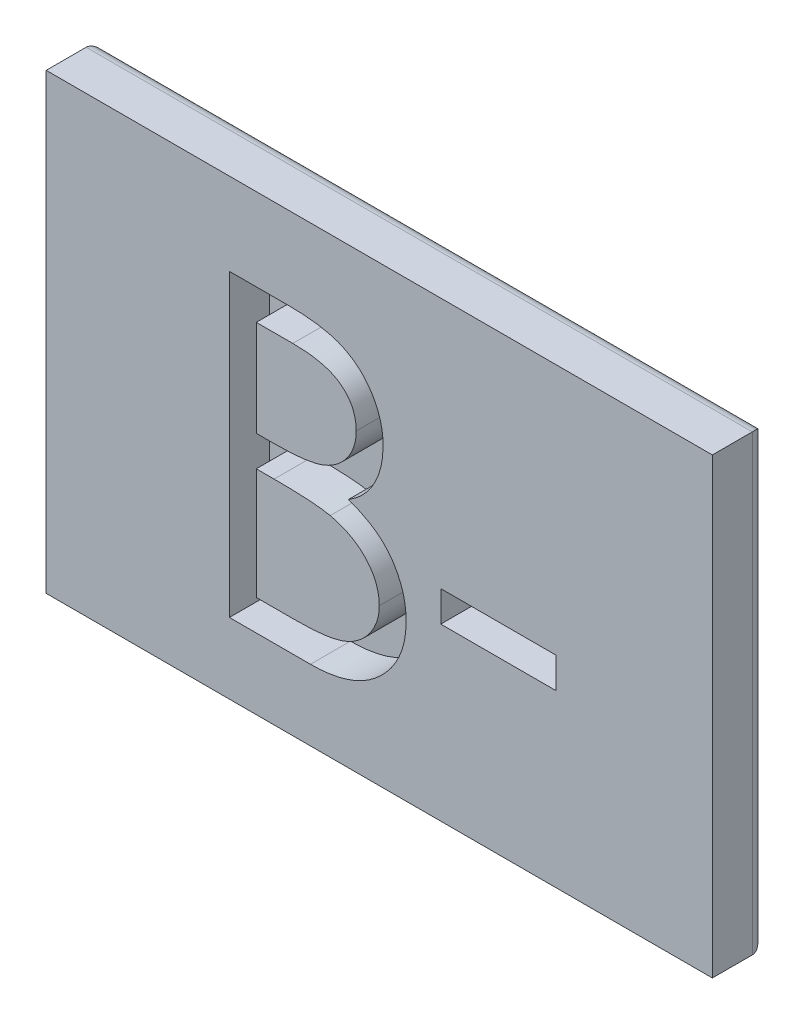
from build123d import *

# Parameters (mm, degrees)
SKETCH1_W           = 31.75
SKETCH1_H           = 21.59
BOSS_EXTRUDE1_DEPTH = 2.54
FILLET1_R           = 0.635
SKETCH2_W           = 5.495192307
SKETCH2_H           = 1.465384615
CUT_EXTRUDE1_DEPTH  = 1.905


with BuildPart() as part:
    # Sketch1 → Boss-Extrude1 (new body)
    with BuildSketch(Plane.XY):
        Rectangle(SKETCH1_W, SKETCH1_H)
    extrude(amount=BOSS_EXTRUDE1_DEPTH)

    # Fillet1
    fillet1_edges = [part.edges().sort_by_distance(p)[0] for p in [
        (0, -10.795, 0),
        (-15.875, 0, 0),
        (0, 10.795, 0),
        (15.875, 0, 0),
    ]]
    fillet(fillet1_edges, radius=FILLET1_R)

    # Sketch2 → Cut-Extrude1 (cut)
    # profile 1 of 2: a face of its own
    with BuildSketch(Plane.XY.offset(2.54)):
        with BuildLine():
            Line((-7.14375, 6.864769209), (-4.356084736, 6.864769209))
            add(Edge.make_bspline(
                [(-4.356084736, 6.864769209), (-4.219624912, 6.864051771), (-3.955131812, 6.862661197), (-3.570514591, 6.841094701), (-3.210270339, 6.811688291), (-2.874294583, 6.76502902), (-2.562742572, 6.708729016), (-2.274675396, 6.640549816), (-2.011009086, 6.558798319), (-1.69622388, 6.428797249), (-1.337319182, 6.235617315), (-0.948705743, 5.950158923), (-0.616402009, 5.601003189), (-0.329891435, 5.207147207), (-0.102103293, 4.773885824), (0.062689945, 4.311545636), (0.167020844, 3.826090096), (0.177750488, 3.492810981), (0.183173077, 3.324377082)],
                knots=[0, 0, 0, 0, 1.001505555, 1.941167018, 2.826882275, 3.653841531, 4.429895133, 5.150066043, 5.825578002, 6.45369114, 7.647487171, 8.808567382, 9.977351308, 11.170798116, 12.373658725, 13.556498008, 14.765093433, 16, 16, 16, 16], degree=3))
            add(Edge.make_bspline(
                [(0.183173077, 3.324377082), (0.178710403, 3.166591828), (0.169940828, 2.856528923), (0.08608235, 2.403026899), (-0.045202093, 1.971335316), (-0.227695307, 1.56302965), (-0.464875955, 1.187335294), (-0.745965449, 0.841221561), (-1.085096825, 0.539342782), (-1.339182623, 0.370575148), (-1.468246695, 0.284848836)],
                knots=[0, 0, 0, 0, 1.044552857, 2.05264487, 3.044412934, 4.028983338, 5.005914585, 5.980388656, 6.974128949, 8, 8, 8, 8], degree=3))
            add(Edge.make_bspline(
                [(-1.468246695, 0.284848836), (-1.305938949, 0.22253493), (-0.995404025, 0.103312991), (-0.568060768, -0.10747035), (-0.199872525, -0.336732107), (0.111991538, -0.587097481), (0.37870918, -0.856963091), (0.611607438, -1.150285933), (0.810331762, -1.470892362), (0.980609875, -1.815439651), (1.113478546, -2.180409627), (1.21298447, -2.562378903), (1.270001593, -2.959977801), (1.278115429, -3.230564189), (1.282211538, -3.367164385)],
                knots=[0, 0, 0, 0, 1.27268992, 2.434971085, 3.483601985, 4.442670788, 5.356604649, 6.2567628, 7.179492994, 8.113709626, 9.066344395, 10.018646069, 10.999752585, 12, 12, 12, 12], degree=3))
            add(Edge.make_bspline(
                [(1.282211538, -3.367164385), (1.278223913, -3.506638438), (1.27037815, -3.781057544), (1.212493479, -4.184190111), (1.114484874, -4.569442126), (0.97948373, -4.939305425), (0.803288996, -5.293064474), (0.588862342, -5.631120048), (0.333191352, -5.950075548), (0.047184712, -6.253475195), (-0.276374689, -6.52627577), (-0.625462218, -6.769227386), (-1.004474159, -6.969032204), (-1.407185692, -7.136873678), (-1.838114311, -7.265082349), (-2.295324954, -7.354777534), (-2.778423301, -7.41521381), (-3.109933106, -7.420182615), (-3.279942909, -7.422730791)],
                knots=[0, 0, 0, 0, 0.978564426, 1.925352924, 2.850884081, 3.763762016, 4.682927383, 5.618979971, 6.567305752, 7.547517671, 8.540179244, 9.531824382, 10.526200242, 11.540722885, 12.589160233, 13.674978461, 14.80764778, 16, 16, 16, 16], degree=3))
            Line((-3.279942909, -7.422730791), (-7.14375, -7.422730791))
            Line((-7.14375, -7.422730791), (-7.14375, 6.864769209))
        make_face()
        with BuildLine():
            Line((-5.861538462, 5.399384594), (-5.861538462, 0.820057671))
            Line((-5.861538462, 0.820057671), (-5.000052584, 0.820057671))
            add(Edge.make_bspline(
                [(-5.000052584, 0.820057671), (-4.874123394, 0.821690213), (-4.630802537, 0.824844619), (-4.278432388, 0.833880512), (-3.951350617, 0.85918181), (-3.650121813, 0.884475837), (-3.375220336, 0.925601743), (-3.127255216, 0.974555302), (-2.902334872, 1.026328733), (-2.64295737, 1.11437846), (-2.348745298, 1.244507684), (-2.035101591, 1.446458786), (-1.75859981, 1.686996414), (-1.525112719, 1.964545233), (-1.334021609, 2.270159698), (-1.201295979, 2.598963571), (-1.111295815, 2.942762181), (-1.103166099, 3.178784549), (-1.099038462, 3.298618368)],
                knots=[0, 0, 0, 0, 1.156816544, 2.235205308, 3.236616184, 4.169592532, 5.011045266, 5.787822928, 6.49130361, 7.128639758, 8.301311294, 9.436451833, 10.541879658, 11.654887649, 12.756523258, 13.837046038, 14.901820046, 16, 16, 16, 16], degree=3))
            add(Edge.make_bspline(
                [(-1.099038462, 3.298618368), (-1.101186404, 3.377917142), (-1.105399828, 3.533470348), (-1.139907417, 3.760230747), (-1.198557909, 3.973497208), (-1.27389097, 4.17619238), (-1.379164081, 4.361978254), (-1.503112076, 4.537278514), (-1.652868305, 4.69612334), (-1.82332762, 4.844588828), (-2.019305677, 4.976215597), (-2.240685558, 5.091498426), (-2.490462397, 5.184329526), (-2.764426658, 5.265630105), (-3.066795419, 5.322732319), (-3.394079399, 5.370303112), (-3.748959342, 5.394521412), (-3.994480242, 5.397727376), (-4.121394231, 5.399384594)],
                knots=[0, 0, 0, 0, 0.91205012, 1.789085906, 2.630437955, 3.453916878, 4.269457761, 5.079663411, 5.91843418, 6.774407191, 7.675494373, 8.627863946, 9.638891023, 10.736472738, 11.911756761, 13.175263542, 14.539845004, 16, 16, 16, 16], degree=3))
            Line((-4.121394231, 5.399384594), (-5.861538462, 5.399384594))
        make_face(mode=Mode.SUBTRACT)
        with BuildLine():
            Line((-5.861538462, -0.645326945), (-5.861538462, -5.957346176))
            Line((-5.861538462, -5.957346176), (-4.035531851, -5.957346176))
            add(Edge.make_bspline(
                [(-4.035531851, -5.957346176), (-3.904826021, -5.955779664), (-3.652907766, -5.952760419), (-3.289183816, -5.942903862), (-2.952067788, -5.920483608), (-2.643098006, -5.885190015), (-2.358938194, -5.846905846), (-2.102997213, -5.795424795), (-1.873200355, -5.736442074), (-1.606741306, -5.645270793), (-1.306689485, -5.503634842), (-0.983339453, -5.290080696), (-0.69584957, -5.03566805), (-0.451715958, -4.741219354), (-0.251637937, -4.421051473), (-0.106087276, -4.081640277), (-0.016317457, -3.728593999), (-0.005450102, -3.487883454), (0, -3.367164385)],
                knots=[0, 0, 0, 0, 1.160039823, 2.235823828, 3.228722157, 4.157150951, 4.99529583, 5.772374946, 6.472645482, 7.099169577, 8.269452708, 9.405989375, 10.527446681, 11.663510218, 12.788923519, 13.866172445, 14.929861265, 16, 16, 16, 16], degree=3))
            add(Edge.make_bspline(
                [(0, -3.367164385), (-0.001127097, -3.291671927), (-0.003363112, -3.141904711), (-0.037084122, -2.921812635), (-0.086126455, -2.708619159), (-0.149527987, -2.501745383), (-0.241863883, -2.304931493), (-0.349659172, -2.114284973), (-0.476048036, -1.929553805), (-0.672987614, -1.696005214), (-0.959439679, -1.42692255), (-1.36645698, -1.163471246), (-1.829258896, -0.951004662), (-2.164923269, -0.860791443), (-2.33831881, -0.814189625)],
                knots=[0, 0, 0, 0, 0.723448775, 1.435228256, 2.130040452, 2.821711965, 3.505591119, 4.210454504, 4.921174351, 5.648778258, 7.137944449, 8.670945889, 10.280296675, 12, 12, 12, 12], degree=3))
            add(Edge.make_bspline(
                [(-2.33831881, -0.814189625), (-2.407834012, -0.800085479), (-2.558557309, -0.76950478), (-2.804333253, -0.737224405), (-3.084922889, -0.708465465), (-3.400974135, -0.687192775), (-3.752886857, -0.665204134), (-4.141412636, -0.656652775), (-4.564964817, -0.646450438), (-4.858847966, -0.645711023), (-5.011500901, -0.645326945)],
                knots=[0, 0, 0, 0, 0.634451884, 1.375622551, 2.216452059, 3.157844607, 4.20941857, 5.370758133, 6.634282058, 8, 8, 8, 8], degree=3))
            Line((-5.011500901, -0.645326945), (-5.861538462, -0.645326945))
        make_face(mode=Mode.SUBTRACT)
    # profile 2 of 2: a face of its own
    with BuildSketch(Plane.XY.offset(2.54)):
        with Locations((5.678365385, -1.927538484)):
            Rectangle(SKETCH2_W, SKETCH2_H)
    extrude(amount=-CUT_EXTRUDE1_DEPTH, mode=Mode.SUBTRACT)


solid = part.part
